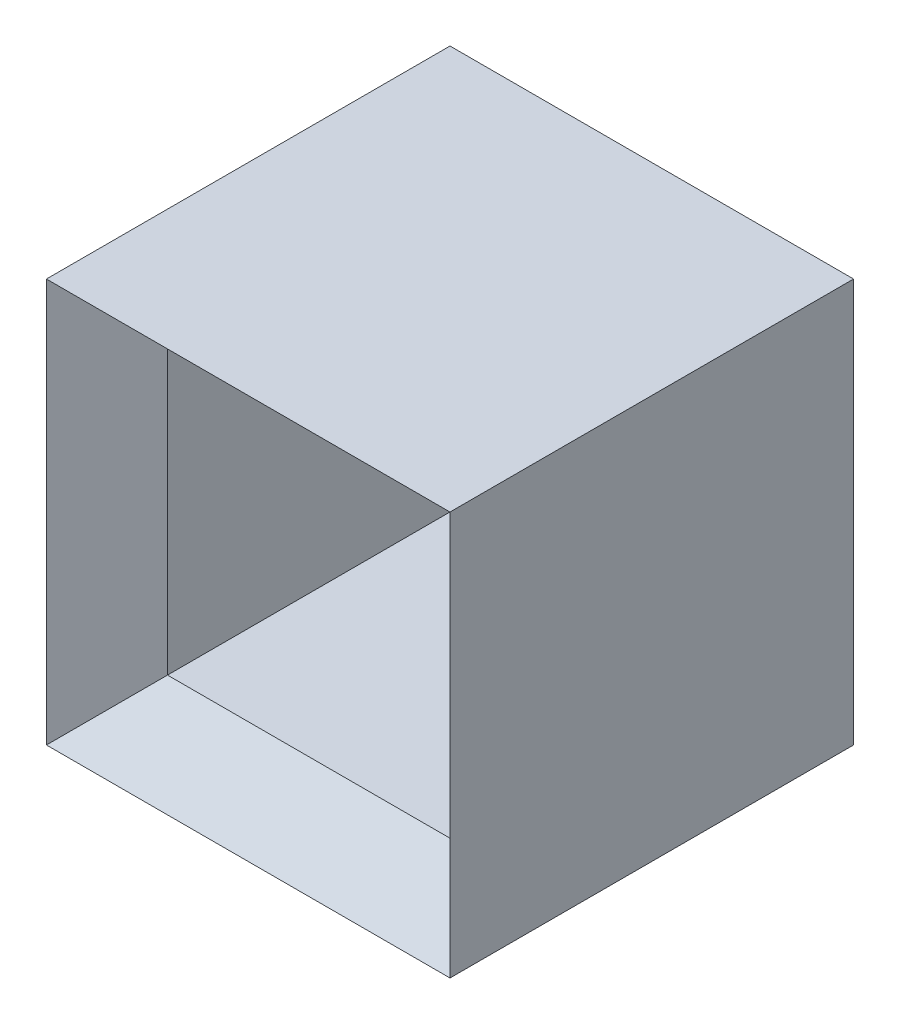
ISO-10303-21;
HEADER;
FILE_DESCRIPTION(('STEP AP214'),'2;1');
FILE_NAME('part.step','',(''),(''),'','','');
FILE_SCHEMA(('AUTOMOTIVE_DESIGN { 1 0 10303 214 1 1 1 1 }'));
ENDSEC;
DATA;
#1=APPLICATION_CONTEXT('core data for automotive mechanical design processes');
#2=APPLICATION_PROTOCOL_DEFINITION('international standard','automotive_design',2000,#1);
#3=PRODUCT_CONTEXT('',#1,'mechanical');
#4=PRODUCT('Part','Part','',(#3));
#5=PRODUCT_RELATED_PRODUCT_CATEGORY('part','',(#4));
#6=PRODUCT_DEFINITION_FORMATION('','',#4);
#7=PRODUCT_DEFINITION_CONTEXT('part definition',#1,'design');
#8=PRODUCT_DEFINITION('design','',#6,#7);
#9=PRODUCT_DEFINITION_SHAPE('','',#8);
#10=(LENGTH_UNIT() NAMED_UNIT(*) SI_UNIT(.MILLI.,.METRE.));
#11=(NAMED_UNIT(*) PLANE_ANGLE_UNIT() SI_UNIT($,.RADIAN.));
#12=(NAMED_UNIT(*) SI_UNIT($,.STERADIAN.) SOLID_ANGLE_UNIT());
#13=UNCERTAINTY_MEASURE_WITH_UNIT(LENGTH_MEASURE(1.E-05),#10,'distance_accuracy_value','');
#14=(GEOMETRIC_REPRESENTATION_CONTEXT(3) GLOBAL_UNCERTAINTY_ASSIGNED_CONTEXT((#13)) GLOBAL_UNIT_ASSIGNED_CONTEXT((#10,
#11,#12)) REPRESENTATION_CONTEXT('',''));
#15=CARTESIAN_POINT('',(0.,0.,0.));
#16=DIRECTION('',(0.,0.,1.));
#17=DIRECTION('',(1.,0.,0.));
#18=AXIS2_PLACEMENT_3D('',#15,#16,#17);
#19=CARTESIAN_POINT('',(-51.8885714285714,45.1757142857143,100.));
#20=DIRECTION('',(1.,0.,0.));
#21=DIRECTION('',(0.,1.,0.));
#22=AXIS2_PLACEMENT_3D('',#19,#20,#21);
#23=PLANE('',#22);
#24=DIRECTION('',(0.,-1.,0.));
#25=VECTOR('',#24,1.);
#26=CARTESIAN_POINT('',(-51.8885714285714,45.1757142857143,0.));
#27=LINE('',#26,#25);
#28=CARTESIAN_POINT('',(-51.8885714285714,45.1757142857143,0.));
#29=VERTEX_POINT('',#28);
#30=CARTESIAN_POINT('',(-51.8885714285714,-54.8242857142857,0.));
#31=VERTEX_POINT('',#30);
#32=EDGE_CURVE('E109',#29,#31,#27,.T.);
#33=ORIENTED_EDGE('',*,*,#32,.T.);
#34=DIRECTION('',(0.,0.,-1.));
#35=VECTOR('',#34,1.);
#36=CARTESIAN_POINT('',(-51.8885714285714,-54.8242857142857,100.));
#37=LINE('',#36,#35);
#38=CARTESIAN_POINT('',(-51.8885714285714,-54.8242857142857,100.));
#39=VERTEX_POINT('',#38);
#40=EDGE_CURVE('E92',#39,#31,#37,.T.);
#41=ORIENTED_EDGE('',*,*,#40,.F.);
#42=DIRECTION('',(0.,-1.,0.));
#43=VECTOR('',#42,1.);
#44=CARTESIAN_POINT('',(-51.8885714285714,45.1757142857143,100.));
#45=LINE('',#44,#43);
#46=CARTESIAN_POINT('',(-51.8885714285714,45.1757142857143,100.));
#47=VERTEX_POINT('',#46);
#48=EDGE_CURVE('E136',#47,#39,#45,.T.);
#49=ORIENTED_EDGE('',*,*,#48,.F.);
#50=DIRECTION('',(0.,0.,-1.));
#51=VECTOR('',#50,1.);
#52=CARTESIAN_POINT('',(-51.8885714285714,45.1757142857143,100.));
#53=LINE('',#52,#51);
#54=EDGE_CURVE('E111',#47,#29,#53,.T.);
#55=ORIENTED_EDGE('',*,*,#54,.T.);
#56=EDGE_LOOP('',(#33,#41,#49,#55));
#57=FACE_BOUND('',#56,.T.);
#58=ADVANCED_FACE('F30',(#57),#23,.F.);
#59=CARTESIAN_POINT('',(-51.8885714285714,-54.8242857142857,100.));
#60=DIRECTION('',(0.,1.,0.));
#61=DIRECTION('',(0.,0.,1.));
#62=AXIS2_PLACEMENT_3D('',#59,#60,#61);
#63=PLANE('',#62);
#64=DIRECTION('',(1.,0.,0.));
#65=VECTOR('',#64,1.);
#66=CARTESIAN_POINT('',(-51.8885714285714,-54.8242857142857,0.));
#67=LINE('',#66,#65);
#68=CARTESIAN_POINT('',(48.1114285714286,-54.8242857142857,0.));
#69=VERTEX_POINT('',#68);
#70=EDGE_CURVE('E97',#31,#69,#67,.T.);
#71=ORIENTED_EDGE('',*,*,#70,.T.);
#72=DIRECTION('',(0.,0.,-1.));
#73=VECTOR('',#72,1.);
#74=CARTESIAN_POINT('',(48.1114285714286,-54.8242857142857,100.));
#75=LINE('',#74,#73);
#76=CARTESIAN_POINT('',(48.1114285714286,-54.8242857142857,100.));
#77=VERTEX_POINT('',#76);
#78=EDGE_CURVE('E105',#77,#69,#75,.T.);
#79=ORIENTED_EDGE('',*,*,#78,.F.);
#80=DIRECTION('',(1.,0.,0.));
#81=VECTOR('',#80,1.);
#82=CARTESIAN_POINT('',(-51.8885714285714,-54.8242857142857,100.));
#83=LINE('',#82,#81);
#84=EDGE_CURVE('E100',#39,#77,#83,.T.);
#85=ORIENTED_EDGE('',*,*,#84,.F.);
#86=ORIENTED_EDGE('',*,*,#40,.T.);
#87=EDGE_LOOP('',(#71,#79,#85,#86));
#88=FACE_BOUND('',#87,.T.);
#89=ADVANCED_FACE('F94',(#88),#63,.F.);
#90=CARTESIAN_POINT('',(48.1114285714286,45.1757142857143,100.));
#91=DIRECTION('',(-1.,0.,0.));
#92=DIRECTION('',(0.,-1.,0.));
#93=AXIS2_PLACEMENT_3D('',#90,#91,#92);
#94=PLANE('',#93);
#95=DIRECTION('',(0.,1.,0.));
#96=VECTOR('',#95,1.);
#97=CARTESIAN_POINT('',(48.1114285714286,45.1757142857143,0.));
#98=LINE('',#97,#96);
#99=CARTESIAN_POINT('',(48.1114285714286,45.1757142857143,0.));
#100=VERTEX_POINT('',#99);
#101=EDGE_CURVE('E128',#69,#100,#98,.T.);
#102=ORIENTED_EDGE('',*,*,#101,.T.);
#103=DIRECTION('',(0.,0.,-1.));
#104=VECTOR('',#103,1.);
#105=CARTESIAN_POINT('',(48.1114285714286,45.1757142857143,100.));
#106=LINE('',#105,#104);
#107=CARTESIAN_POINT('',(48.1114285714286,45.1757142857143,100.));
#108=VERTEX_POINT('',#107);
#109=EDGE_CURVE('E146',#108,#100,#106,.T.);
#110=ORIENTED_EDGE('',*,*,#109,.F.);
#111=DIRECTION('',(0.,1.,0.));
#112=VECTOR('',#111,1.);
#113=CARTESIAN_POINT('',(48.1114285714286,45.1757142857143,100.));
#114=LINE('',#113,#112);
#115=EDGE_CURVE('E139',#77,#108,#114,.T.);
#116=ORIENTED_EDGE('',*,*,#115,.F.);
#117=ORIENTED_EDGE('',*,*,#78,.T.);
#118=EDGE_LOOP('',(#102,#110,#116,#117));
#119=FACE_BOUND('',#118,.T.);
#120=ADVANCED_FACE('F200',(#119),#94,.F.);
#121=CARTESIAN_POINT('',(-51.8885714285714,45.1757142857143,100.));
#122=DIRECTION('',(0.,-1.,0.));
#123=DIRECTION('',(0.,0.,-1.));
#124=AXIS2_PLACEMENT_3D('',#121,#122,#123);
#125=PLANE('',#124);
#126=DIRECTION('',(-1.,0.,0.));
#127=VECTOR('',#126,1.);
#128=CARTESIAN_POINT('',(-51.8885714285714,45.1757142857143,0.));
#129=LINE('',#128,#127);
#130=EDGE_CURVE('E131',#100,#29,#129,.T.);
#131=ORIENTED_EDGE('',*,*,#130,.T.);
#132=ORIENTED_EDGE('',*,*,#54,.F.);
#133=DIRECTION('',(-1.,0.,0.));
#134=VECTOR('',#133,1.);
#135=CARTESIAN_POINT('',(-51.8885714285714,45.1757142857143,100.));
#136=LINE('',#135,#134);
#137=EDGE_CURVE('E142',#108,#47,#136,.T.);
#138=ORIENTED_EDGE('',*,*,#137,.F.);
#139=ORIENTED_EDGE('',*,*,#109,.T.);
#140=EDGE_LOOP('',(#131,#132,#138,#139));
#141=FACE_BOUND('',#140,.T.);
#142=ADVANCED_FACE('F203',(#141),#125,.F.);
#143=CARTESIAN_POINT('',(-36.8885714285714,30.1757142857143,0.));
#144=DIRECTION('',(-1.,0.,0.));
#145=DIRECTION('',(0.,-1.,0.));
#146=AXIS2_PLACEMENT_3D('',#143,#144,#145);
#147=PLANE('',#146);
#148=DIRECTION('',(0.,0.,1.));
#149=VECTOR('',#148,1.);
#150=CARTESIAN_POINT('',(-36.8885714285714,-39.8242857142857,0.));
#151=LINE('',#150,#149);
#152=CARTESIAN_POINT('',(-36.8885714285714,-39.8242857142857,15.));
#153=VERTEX_POINT('',#152);
#154=CARTESIAN_POINT('',(-36.8885714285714,-39.8242857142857,85.));
#155=VERTEX_POINT('',#154);
#156=EDGE_CURVE('E175',#153,#155,#151,.T.);
#157=ORIENTED_EDGE('',*,*,#156,.F.);
#158=DIRECTION('',(0.,1.,0.));
#159=VECTOR('',#158,1.);
#160=CARTESIAN_POINT('',(-36.8885714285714,30.1757142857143,15.));
#161=LINE('',#160,#159);
#162=CARTESIAN_POINT('',(-36.8885714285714,30.1757142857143,15.));
#163=VERTEX_POINT('',#162);
#164=EDGE_CURVE('E37',#153,#163,#161,.T.);
#165=ORIENTED_EDGE('',*,*,#164,.T.);
#166=DIRECTION('',(0.,0.,1.));
#167=VECTOR('',#166,1.);
#168=CARTESIAN_POINT('',(-36.8885714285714,30.1757142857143,0.));
#169=LINE('',#168,#167);
#170=CARTESIAN_POINT('',(-36.8885714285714,30.1757142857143,85.));
#171=VERTEX_POINT('',#170);
#172=EDGE_CURVE('E115',#163,#171,#169,.T.);
#173=ORIENTED_EDGE('',*,*,#172,.T.);
#174=DIRECTION('',(0.,-1.,0.));
#175=VECTOR('',#174,1.);
#176=CARTESIAN_POINT('',(-36.8885714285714,-39.8242857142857,85.));
#177=LINE('',#176,#175);
#178=EDGE_CURVE('E155',#171,#155,#177,.T.);
#179=ORIENTED_EDGE('',*,*,#178,.T.);
#180=EDGE_LOOP('',(#157,#165,#173,#179));
#181=FACE_BOUND('',#180,.T.);
#182=ADVANCED_FACE('F218',(#181),#147,.F.);
#183=CARTESIAN_POINT('',(-36.8885714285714,30.1757142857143,0.));
#184=DIRECTION('',(0.,1.,0.));
#185=DIRECTION('',(0.,0.,1.));
#186=AXIS2_PLACEMENT_3D('',#183,#184,#185);
#187=PLANE('',#186);
#188=ORIENTED_EDGE('',*,*,#172,.F.);
#189=DIRECTION('',(1.,0.,0.));
#190=VECTOR('',#189,1.);
#191=CARTESIAN_POINT('',(-36.8885714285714,30.1757142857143,15.));
#192=LINE('',#191,#190);
#193=CARTESIAN_POINT('',(33.1114285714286,30.1757142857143,15.));
#194=VERTEX_POINT('',#193);
#195=EDGE_CURVE('E11',#163,#194,#192,.T.);
#196=ORIENTED_EDGE('',*,*,#195,.T.);
#197=DIRECTION('',(0.,0.,1.));
#198=VECTOR('',#197,1.);
#199=CARTESIAN_POINT('',(33.1114285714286,30.1757142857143,0.));
#200=LINE('',#199,#198);
#201=CARTESIAN_POINT('',(33.1114285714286,30.1757142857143,85.));
#202=VERTEX_POINT('',#201);
#203=EDGE_CURVE('E169',#194,#202,#200,.T.);
#204=ORIENTED_EDGE('',*,*,#203,.T.);
#205=DIRECTION('',(-1.,0.,0.));
#206=VECTOR('',#205,1.);
#207=CARTESIAN_POINT('',(-36.8885714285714,30.1757142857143,85.));
#208=LINE('',#207,#206);
#209=EDGE_CURVE('E158',#202,#171,#208,.T.);
#210=ORIENTED_EDGE('',*,*,#209,.T.);
#211=EDGE_LOOP('',(#188,#196,#204,#210));
#212=FACE_BOUND('',#211,.T.);
#213=ADVANCED_FACE('F214',(#212),#187,.F.);
#214=CARTESIAN_POINT('',(33.1114285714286,30.1757142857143,0.));
#215=DIRECTION('',(1.,0.,0.));
#216=DIRECTION('',(0.,1.,0.));
#217=AXIS2_PLACEMENT_3D('',#214,#215,#216);
#218=PLANE('',#217);
#219=ORIENTED_EDGE('',*,*,#203,.F.);
#220=DIRECTION('',(0.,-1.,0.));
#221=VECTOR('',#220,1.);
#222=CARTESIAN_POINT('',(33.1114285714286,30.1757142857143,15.));
#223=LINE('',#222,#221);
#224=CARTESIAN_POINT('',(33.1114285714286,-39.8242857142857,15.));
#225=VERTEX_POINT('',#224);
#226=EDGE_CURVE('E161',#194,#225,#223,.T.);
#227=ORIENTED_EDGE('',*,*,#226,.T.);
#228=DIRECTION('',(0.,0.,1.));
#229=VECTOR('',#228,1.);
#230=CARTESIAN_POINT('',(33.1114285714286,-39.8242857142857,0.));
#231=LINE('',#230,#229);
#232=CARTESIAN_POINT('',(33.1114285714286,-39.8242857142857,85.));
#233=VERTEX_POINT('',#232);
#234=EDGE_CURVE('E168',#225,#233,#231,.T.);
#235=ORIENTED_EDGE('',*,*,#234,.T.);
#236=DIRECTION('',(0.,1.,0.));
#237=VECTOR('',#236,1.);
#238=CARTESIAN_POINT('',(33.1114285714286,30.1757142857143,85.));
#239=LINE('',#238,#237);
#240=EDGE_CURVE('E104',#233,#202,#239,.T.);
#241=ORIENTED_EDGE('',*,*,#240,.T.);
#242=EDGE_LOOP('',(#219,#227,#235,#241));
#243=FACE_BOUND('',#242,.T.);
#244=ADVANCED_FACE('F167',(#243),#218,.F.);
#245=CARTESIAN_POINT('',(-36.8885714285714,-39.8242857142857,0.));
#246=DIRECTION('',(0.,-1.,0.));
#247=DIRECTION('',(0.,0.,-1.));
#248=AXIS2_PLACEMENT_3D('',#245,#246,#247);
#249=PLANE('',#248);
#250=ORIENTED_EDGE('',*,*,#234,.F.);
#251=DIRECTION('',(-1.,0.,0.));
#252=VECTOR('',#251,1.);
#253=CARTESIAN_POINT('',(-36.8885714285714,-39.8242857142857,15.));
#254=LINE('',#253,#252);
#255=EDGE_CURVE('E51',#225,#153,#254,.T.);
#256=ORIENTED_EDGE('',*,*,#255,.T.);
#257=ORIENTED_EDGE('',*,*,#156,.T.);
#258=DIRECTION('',(1.,0.,0.));
#259=VECTOR('',#258,1.);
#260=CARTESIAN_POINT('',(33.1114285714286,-39.8242857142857,85.));
#261=LINE('',#260,#259);
#262=EDGE_CURVE('E152',#155,#233,#261,.T.);
#263=ORIENTED_EDGE('',*,*,#262,.T.);
#264=EDGE_LOOP('',(#250,#256,#257,#263));
#265=FACE_BOUND('',#264,.T.);
#266=ADVANCED_FACE('F172',(#265),#249,.F.);
#267=CARTESIAN_POINT('',(-36.8885714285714,30.1757142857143,85.));
#268=DIRECTION('',(0.707106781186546,0.,0.707106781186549));
#269=DIRECTION('',(0.707106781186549,0.,-0.707106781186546));
#270=AXIS2_PLACEMENT_3D('',#267,#268,#269);
#271=PLANE('',#270);
#272=DIRECTION('',(0.577350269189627,-0.577350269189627,-0.577350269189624));
#273=VECTOR('',#272,1.);
#274=CARTESIAN_POINT('',(-36.8885714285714,30.1757142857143,85.));
#275=LINE('',#274,#273);
#276=EDGE_CURVE('E183',#47,#171,#275,.T.);
#277=ORIENTED_EDGE('',*,*,#276,.F.);
#278=ORIENTED_EDGE('',*,*,#48,.T.);
#279=DIRECTION('',(0.577350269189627,0.577350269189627,-0.577350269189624));
#280=VECTOR('',#279,1.);
#281=CARTESIAN_POINT('',(-36.8885714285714,-39.8242857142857,85.));
#282=LINE('',#281,#280);
#283=EDGE_CURVE('E178',#155,#39,#282,.F.);
#284=ORIENTED_EDGE('',*,*,#283,.F.);
#285=ORIENTED_EDGE('',*,*,#178,.F.);
#286=EDGE_LOOP('',(#277,#278,#284,#285));
#287=FACE_BOUND('',#286,.T.);
#288=ADVANCED_FACE('F217',(#287),#271,.T.);
#289=CARTESIAN_POINT('',(-36.8885714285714,-39.8242857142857,85.));
#290=DIRECTION('',(0.,0.707106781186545,0.707106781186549));
#291=DIRECTION('',(0.,-0.70710678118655,0.707106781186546));
#292=AXIS2_PLACEMENT_3D('',#289,#290,#291);
#293=PLANE('',#292);
#294=ORIENTED_EDGE('',*,*,#283,.T.);
#295=ORIENTED_EDGE('',*,*,#84,.T.);
#296=DIRECTION('',(-0.577350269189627,0.577350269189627,-0.577350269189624));
#297=VECTOR('',#296,1.);
#298=CARTESIAN_POINT('',(9.77809523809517,-16.4909523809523,61.6666666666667));
#299=LINE('',#298,#297);
#300=EDGE_CURVE('E186',#233,#77,#299,.F.);
#301=ORIENTED_EDGE('',*,*,#300,.F.);
#302=ORIENTED_EDGE('',*,*,#262,.F.);
#303=EDGE_LOOP('',(#294,#295,#301,#302));
#304=FACE_BOUND('',#303,.T.);
#305=ADVANCED_FACE('F311',(#304),#293,.T.);
#306=CARTESIAN_POINT('',(-36.8885714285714,30.1757142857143,85.));
#307=DIRECTION('',(0.,-0.707106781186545,0.707106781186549));
#308=DIRECTION('',(0.,-0.70710678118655,-0.707106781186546));
#309=AXIS2_PLACEMENT_3D('',#306,#307,#308);
#310=PLANE('',#309);
#311=ORIENTED_EDGE('',*,*,#276,.T.);
#312=ORIENTED_EDGE('',*,*,#209,.F.);
#313=DIRECTION('',(0.577350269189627,0.577350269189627,0.577350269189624));
#314=VECTOR('',#313,1.);
#315=CARTESIAN_POINT('',(33.1114285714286,30.1757142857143,85.));
#316=LINE('',#315,#314);
#317=EDGE_CURVE('E121',#108,#202,#316,.F.);
#318=ORIENTED_EDGE('',*,*,#317,.F.);
#319=ORIENTED_EDGE('',*,*,#137,.T.);
#320=EDGE_LOOP('',(#311,#312,#318,#319));
#321=FACE_BOUND('',#320,.T.);
#322=ADVANCED_FACE('F210',(#321),#310,.T.);
#323=CARTESIAN_POINT('',(33.1114285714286,30.1757142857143,85.));
#324=DIRECTION('',(-0.707106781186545,0.,0.70710678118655));
#325=DIRECTION('',(0.70710678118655,0.,0.707106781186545));
#326=AXIS2_PLACEMENT_3D('',#323,#324,#325);
#327=PLANE('',#326);
#328=ORIENTED_EDGE('',*,*,#300,.T.);
#329=ORIENTED_EDGE('',*,*,#115,.T.);
#330=ORIENTED_EDGE('',*,*,#317,.T.);
#331=ORIENTED_EDGE('',*,*,#240,.F.);
#332=EDGE_LOOP('',(#328,#329,#330,#331));
#333=FACE_BOUND('',#332,.T.);
#334=ADVANCED_FACE('F207',(#333),#327,.T.);
#335=CARTESIAN_POINT('',(-51.8885714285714,45.1757142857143,0.));
#336=DIRECTION('',(-0.707106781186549,0.,0.707106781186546));
#337=DIRECTION('',(0.707106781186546,0.,0.707106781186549));
#338=AXIS2_PLACEMENT_3D('',#335,#336,#337);
#339=PLANE('',#338);
#340=DIRECTION('',(-0.577350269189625,0.577350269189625,-0.577350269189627));
#341=VECTOR('',#340,1.);
#342=CARTESIAN_POINT('',(-51.8885714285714,45.1757142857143,0.));
#343=LINE('',#342,#341);
#344=EDGE_CURVE('E122',#163,#29,#343,.T.);
#345=ORIENTED_EDGE('',*,*,#344,.F.);
#346=ORIENTED_EDGE('',*,*,#164,.F.);
#347=DIRECTION('',(-0.577350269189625,-0.577350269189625,-0.577350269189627));
#348=VECTOR('',#347,1.);
#349=CARTESIAN_POINT('',(-51.8885714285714,-54.8242857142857,0.));
#350=LINE('',#349,#348);
#351=EDGE_CURVE('E118',#31,#153,#350,.F.);
#352=ORIENTED_EDGE('',*,*,#351,.F.);
#353=ORIENTED_EDGE('',*,*,#32,.F.);
#354=EDGE_LOOP('',(#345,#346,#352,#353));
#355=FACE_BOUND('',#354,.T.);
#356=ADVANCED_FACE('F119',(#355),#339,.F.);
#357=CARTESIAN_POINT('',(-51.8885714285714,-54.8242857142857,0.));
#358=DIRECTION('',(0.,-0.707106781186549,0.707106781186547));
#359=DIRECTION('',(0.,-0.707106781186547,-0.707106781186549));
#360=AXIS2_PLACEMENT_3D('',#357,#358,#359);
#361=PLANE('',#360);
#362=ORIENTED_EDGE('',*,*,#351,.T.);
#363=ORIENTED_EDGE('',*,*,#255,.F.);
#364=DIRECTION('',(0.577350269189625,-0.577350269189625,-0.577350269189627));
#365=VECTOR('',#364,1.);
#366=CARTESIAN_POINT('',(14.7780952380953,-21.4909523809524,33.3333333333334));
#367=LINE('',#366,#365);
#368=EDGE_CURVE('E126',#69,#225,#367,.F.);
#369=ORIENTED_EDGE('',*,*,#368,.F.);
#370=ORIENTED_EDGE('',*,*,#70,.F.);
#371=EDGE_LOOP('',(#362,#363,#369,#370));
#372=FACE_BOUND('',#371,.T.);
#373=ADVANCED_FACE('F125',(#372),#361,.F.);
#374=CARTESIAN_POINT('',(-51.8885714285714,45.1757142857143,0.));
#375=DIRECTION('',(0.,0.707106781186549,0.707106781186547));
#376=DIRECTION('',(0.,-0.707106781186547,0.707106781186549));
#377=AXIS2_PLACEMENT_3D('',#374,#375,#376);
#378=PLANE('',#377);
#379=ORIENTED_EDGE('',*,*,#344,.T.);
#380=ORIENTED_EDGE('',*,*,#130,.F.);
#381=DIRECTION('',(-0.577350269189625,-0.577350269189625,0.577350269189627));
#382=VECTOR('',#381,1.);
#383=CARTESIAN_POINT('',(48.1114285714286,45.1757142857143,0.));
#384=LINE('',#383,#382);
#385=EDGE_CURVE('E192',#194,#100,#384,.F.);
#386=ORIENTED_EDGE('',*,*,#385,.F.);
#387=ORIENTED_EDGE('',*,*,#195,.F.);
#388=EDGE_LOOP('',(#379,#380,#386,#387));
#389=FACE_BOUND('',#388,.T.);
#390=ADVANCED_FACE('F197',(#389),#378,.F.);
#391=CARTESIAN_POINT('',(48.1114285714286,45.1757142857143,0.));
#392=DIRECTION('',(0.707106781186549,0.,0.707106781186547));
#393=DIRECTION('',(0.707106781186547,0.,-0.707106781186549));
#394=AXIS2_PLACEMENT_3D('',#391,#392,#393);
#395=PLANE('',#394);
#396=ORIENTED_EDGE('',*,*,#368,.T.);
#397=ORIENTED_EDGE('',*,*,#226,.F.);
#398=ORIENTED_EDGE('',*,*,#385,.T.);
#399=ORIENTED_EDGE('',*,*,#101,.F.);
#400=EDGE_LOOP('',(#396,#397,#398,#399));
#401=FACE_BOUND('',#400,.T.);
#402=ADVANCED_FACE('F194',(#401),#395,.F.);
#403=CLOSED_SHELL('',(#58,#89,#120,#142,#182,#213,#244,#266,#288,#305,#322,#334,#356,#373,#390,#402));
#404=MANIFOLD_SOLID_BREP('B2',#403);
#405=ADVANCED_BREP_SHAPE_REPRESENTATION('',(#18,#404),#14);
#406=SHAPE_DEFINITION_REPRESENTATION(#9,#405);
ENDSEC;
END-ISO-10303-21;
